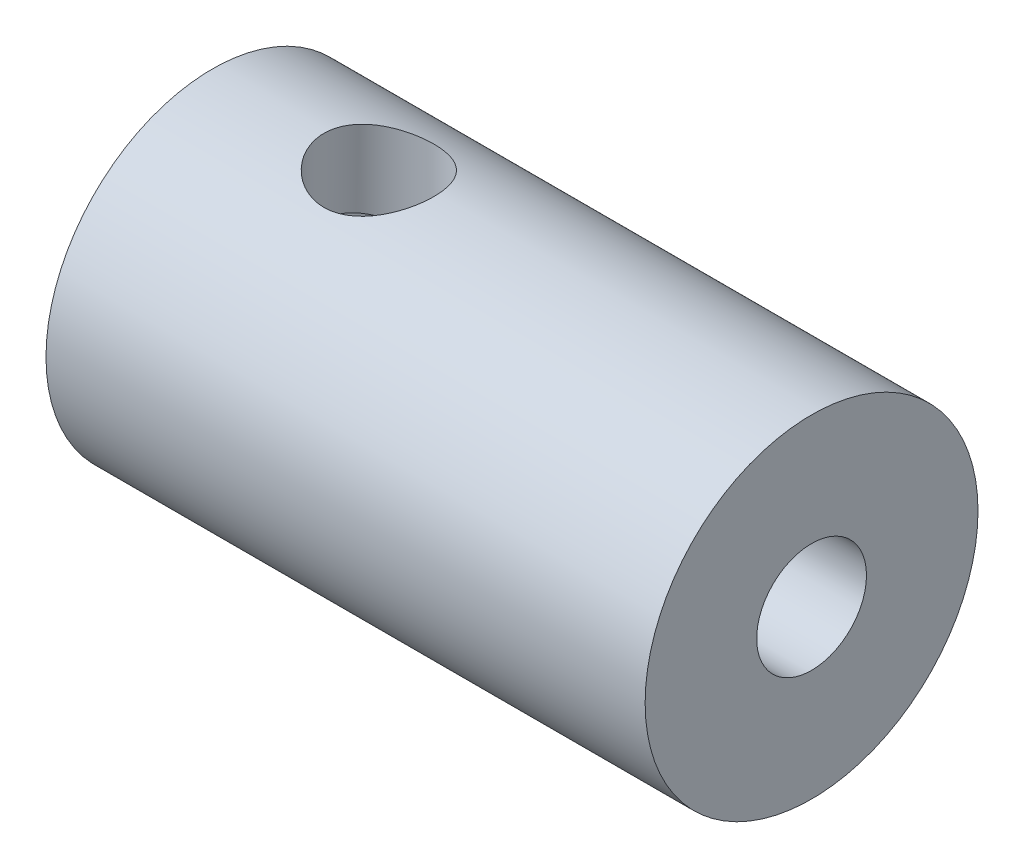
from build123d import *

# Parameters (mm, degrees)
SKETCH1_R                      = 5
BOSS_EXTRUDE1_DEPTH            = 18
M4_TAPPED_HOLE1_D              = 3.3
F_5_5_5_5_DIAMETER_HOLE1_D     = 5.5
F_5_5_5_5_DIAMETER_HOLE1_DEPTH = 10
F_5_5_5_5_DIAMETER_HOLE1_TIP   = 1.652366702
M4_TAPPED_HOLE7_D              = 3.3
M4_TAPPED_HOLE7_DEPTH          = 25
M4_TAPPED_HOLE7_TIP            = 0.991420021


with BuildPart() as part:
    # Sketch1 → Boss-Extrude1 (new body)
    with BuildSketch(Plane(origin=(0, 0, 0), x_dir=(0, 0, -1), z_dir=(1, 0, 0))):
        Circle(SKETCH1_R)
    extrude(amount=BOSS_EXTRUDE1_DEPTH)

    # M4 Tapped Hole1 (through all)
    with Locations(Plane(origin=(18, 0, 0), x_dir=(0, 0, -1), z_dir=(1, 0, 0))):
        with Locations((0, 0)):
            Hole(M4_TAPPED_HOLE1_D / 2)

    # 5.5 _5.5_ Diameter Hole1
    with Locations(Plane.ZY):
        with Locations((0, 0)):
            Hole(F_5_5_5_5_DIAMETER_HOLE1_D / 2, depth=F_5_5_5_5_DIAMETER_HOLE1_DEPTH)
            with Locations((0, 0, -(F_5_5_5_5_DIAMETER_HOLE1_DEPTH + F_5_5_5_5_DIAMETER_HOLE1_TIP / 2))):  # 118° drill point
                Cone(0, F_5_5_5_5_DIAMETER_HOLE1_D / 2, F_5_5_5_5_DIAMETER_HOLE1_TIP, mode=Mode.SUBTRACT)

    # M4 Tapped Hole7
    with Locations(Plane(origin=(5, 5, 0), x_dir=(0, 0, 1), z_dir=(0, 1, 0))):
        with Locations((0, 0)):
            Hole(M4_TAPPED_HOLE7_D / 2, depth=M4_TAPPED_HOLE7_DEPTH)
            with Locations((0, 0, -(M4_TAPPED_HOLE7_DEPTH + M4_TAPPED_HOLE7_TIP / 2))):  # 118° drill point
                Cone(0, M4_TAPPED_HOLE7_D / 2, M4_TAPPED_HOLE7_TIP, mode=Mode.SUBTRACT)


solid = part.part
